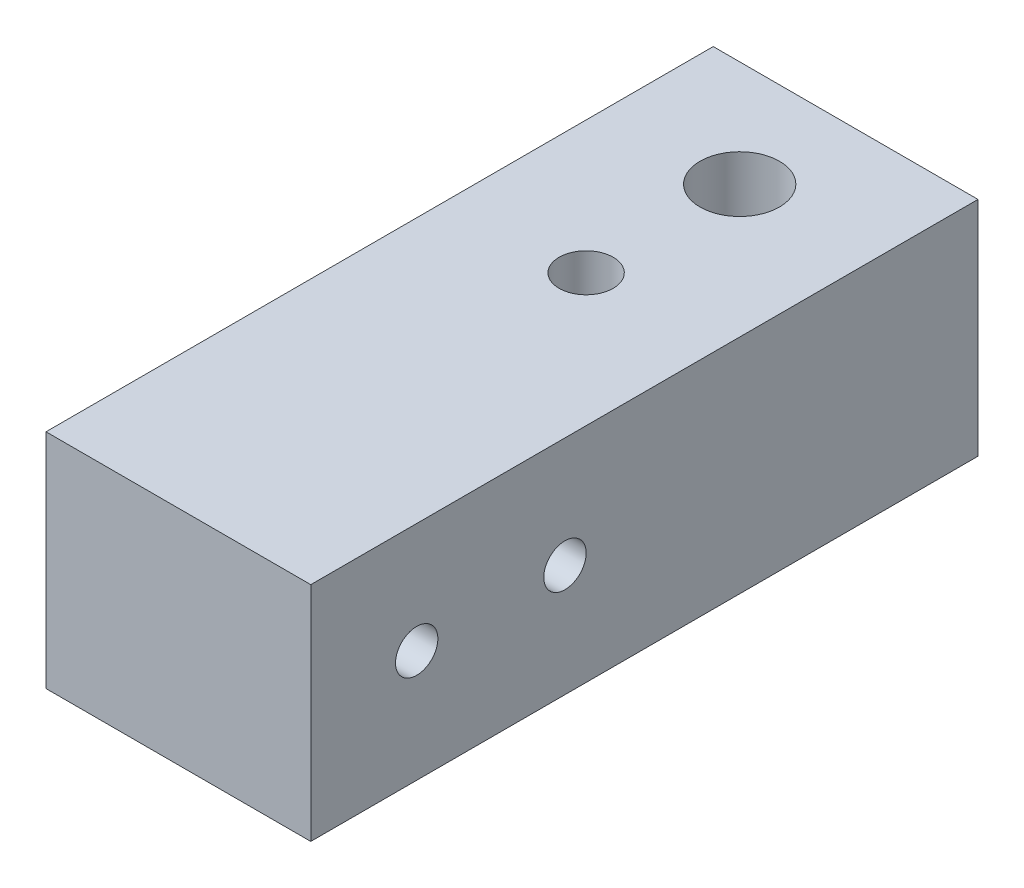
ISO-10303-21;
HEADER;
FILE_DESCRIPTION(('STEP AP214'),'2;1');
FILE_NAME('part.step','',(''),(''),'','','');
FILE_SCHEMA(('AUTOMOTIVE_DESIGN { 1 0 10303 214 1 1 1 1 }'));
ENDSEC;
DATA;
#1=APPLICATION_CONTEXT('core data for automotive mechanical design processes');
#2=APPLICATION_PROTOCOL_DEFINITION('international standard','automotive_design',2000,#1);
#3=PRODUCT_CONTEXT('',#1,'mechanical');
#4=PRODUCT('Part','Part','',(#3));
#5=PRODUCT_RELATED_PRODUCT_CATEGORY('part','',(#4));
#6=PRODUCT_DEFINITION_FORMATION('','',#4);
#7=PRODUCT_DEFINITION_CONTEXT('part definition',#1,'design');
#8=PRODUCT_DEFINITION('design','',#6,#7);
#9=PRODUCT_DEFINITION_SHAPE('','',#8);
#10=(LENGTH_UNIT() NAMED_UNIT(*) SI_UNIT(.MILLI.,.METRE.));
#11=(NAMED_UNIT(*) PLANE_ANGLE_UNIT() SI_UNIT($,.RADIAN.));
#12=(NAMED_UNIT(*) SI_UNIT($,.STERADIAN.) SOLID_ANGLE_UNIT());
#13=UNCERTAINTY_MEASURE_WITH_UNIT(LENGTH_MEASURE(1.E-05),#10,'distance_accuracy_value','');
#14=(GEOMETRIC_REPRESENTATION_CONTEXT(3) GLOBAL_UNCERTAINTY_ASSIGNED_CONTEXT((#13)) GLOBAL_UNIT_ASSIGNED_CONTEXT((#10,
#11,#12)) REPRESENTATION_CONTEXT('',''));
#15=CARTESIAN_POINT('',(0.,0.,0.));
#16=DIRECTION('',(0.,0.,1.));
#17=DIRECTION('',(1.,0.,0.));
#18=AXIS2_PLACEMENT_3D('',#15,#16,#17);
#19=CARTESIAN_POINT('',(552.991736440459,42.,-62.3836591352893));
#20=DIRECTION('',(0.,-1.,0.));
#21=DIRECTION('',(0.,0.,-1.));
#22=AXIS2_PLACEMENT_3D('',#19,#20,#21);
#23=CYLINDRICAL_SURFACE('',#22,3.99999999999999);
#24=CARTESIAN_POINT('',(552.991736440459,0.,-62.3836591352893));
#25=DIRECTION('',(0.,1.,0.));
#26=DIRECTION('',(0.,0.,1.));
#27=AXIS2_PLACEMENT_3D('',#24,#25,#26);
#28=CIRCLE('',#27,3.99999999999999);
#29=CARTESIAN_POINT('',(552.991736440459,0.,-66.3836591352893));
#30=VERTEX_POINT('',#29);
#31=EDGE_CURVE('E135',#30,#30,#28,.T.);
#32=CARTESIAN_POINT('',(552.991736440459,14.,-62.3836591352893));
#33=DIRECTION('',(0.,1.,0.));
#34=DIRECTION('',(0.,0.,1.));
#35=AXIS2_PLACEMENT_3D('',#32,#33,#34);
#36=CIRCLE('',#35,3.99999999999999);
#37=CARTESIAN_POINT('',(552.991736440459,14.,-66.3836591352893));
#38=VERTEX_POINT('',#37);
#39=EDGE_CURVE('E63',#38,#38,#36,.T.);
#40=CARTESIAN_POINT('',(552.991736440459,0.,-66.3836591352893));
#41=CARTESIAN_POINT('',(552.991736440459,0.145833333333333,-66.3836591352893));
#42=CARTESIAN_POINT('',(552.991736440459,0.291666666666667,-66.3836591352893));
#43=CARTESIAN_POINT('',(552.991736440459,0.583333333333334,-66.3836591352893));
#44=CARTESIAN_POINT('',(552.991736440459,0.729166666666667,-66.3836591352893));
#45=CARTESIAN_POINT('',(552.991736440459,1.02083333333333,-66.3836591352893));
#46=CARTESIAN_POINT('',(552.991736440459,1.16666666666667,-66.3836591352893));
#47=CARTESIAN_POINT('',(552.991736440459,1.45833333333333,-66.3836591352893));
#48=CARTESIAN_POINT('',(552.991736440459,1.60416666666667,-66.3836591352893));
#49=CARTESIAN_POINT('',(552.991736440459,1.89583333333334,-66.3836591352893));
#50=CARTESIAN_POINT('',(552.991736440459,2.04166666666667,-66.3836591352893));
#51=CARTESIAN_POINT('',(552.991736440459,2.33333333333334,-66.3836591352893));
#52=CARTESIAN_POINT('',(552.991736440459,2.47916666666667,-66.3836591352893));
#53=CARTESIAN_POINT('',(552.991736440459,2.77083333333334,-66.3836591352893));
#54=CARTESIAN_POINT('',(552.991736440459,2.91666666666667,-66.3836591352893));
#55=CARTESIAN_POINT('',(552.991736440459,3.20833333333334,-66.3836591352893));
#56=CARTESIAN_POINT('',(552.991736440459,3.35416666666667,-66.3836591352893));
#57=CARTESIAN_POINT('',(552.991736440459,3.64583333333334,-66.3836591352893));
#58=CARTESIAN_POINT('',(552.991736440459,3.79166666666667,-66.3836591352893));
#59=CARTESIAN_POINT('',(552.991736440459,4.08333333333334,-66.3836591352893));
#60=CARTESIAN_POINT('',(552.991736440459,4.22916666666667,-66.3836591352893));
#61=CARTESIAN_POINT('',(552.991736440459,4.52083333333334,-66.3836591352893));
#62=CARTESIAN_POINT('',(552.991736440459,4.66666666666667,-66.3836591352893));
#63=CARTESIAN_POINT('',(552.991736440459,4.95833333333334,-66.3836591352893));
#64=CARTESIAN_POINT('',(552.991736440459,5.10416666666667,-66.3836591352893));
#65=CARTESIAN_POINT('',(552.991736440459,5.39583333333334,-66.3836591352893));
#66=CARTESIAN_POINT('',(552.991736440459,5.54166666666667,-66.3836591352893));
#67=CARTESIAN_POINT('',(552.991736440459,5.83333333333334,-66.3836591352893));
#68=CARTESIAN_POINT('',(552.991736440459,5.97916666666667,-66.3836591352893));
#69=CARTESIAN_POINT('',(552.991736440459,6.27083333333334,-66.3836591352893));
#70=CARTESIAN_POINT('',(552.991736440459,6.41666666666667,-66.3836591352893));
#71=CARTESIAN_POINT('',(552.991736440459,6.70833333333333,-66.3836591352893));
#72=CARTESIAN_POINT('',(552.991736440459,6.85416666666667,-66.3836591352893));
#73=CARTESIAN_POINT('',(552.991736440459,7.14583333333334,-66.3836591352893));
#74=CARTESIAN_POINT('',(552.991736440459,7.29166666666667,-66.3836591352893));
#75=CARTESIAN_POINT('',(552.991736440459,7.58333333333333,-66.3836591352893));
#76=CARTESIAN_POINT('',(552.991736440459,7.72916666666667,-66.3836591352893));
#77=CARTESIAN_POINT('',(552.991736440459,8.02083333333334,-66.3836591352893));
#78=CARTESIAN_POINT('',(552.991736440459,8.16666666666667,-66.3836591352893));
#79=CARTESIAN_POINT('',(552.991736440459,8.45833333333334,-66.3836591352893));
#80=CARTESIAN_POINT('',(552.991736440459,8.60416666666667,-66.3836591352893));
#81=CARTESIAN_POINT('',(552.991736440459,8.89583333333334,-66.3836591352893));
#82=CARTESIAN_POINT('',(552.991736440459,9.04166666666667,-66.3836591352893));
#83=CARTESIAN_POINT('',(552.991736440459,9.33333333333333,-66.3836591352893));
#84=CARTESIAN_POINT('',(552.991736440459,9.47916666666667,-66.3836591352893));
#85=CARTESIAN_POINT('',(552.991736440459,9.77083333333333,-66.3836591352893));
#86=CARTESIAN_POINT('',(552.991736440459,9.91666666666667,-66.3836591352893));
#87=CARTESIAN_POINT('',(552.991736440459,10.2083333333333,-66.3836591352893));
#88=CARTESIAN_POINT('',(552.991736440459,10.3541666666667,-66.3836591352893));
#89=CARTESIAN_POINT('',(552.991736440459,10.6458333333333,-66.3836591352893));
#90=CARTESIAN_POINT('',(552.991736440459,10.7916666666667,-66.3836591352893));
#91=CARTESIAN_POINT('',(552.991736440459,11.0833333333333,-66.3836591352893));
#92=CARTESIAN_POINT('',(552.991736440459,11.2291666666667,-66.3836591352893));
#93=CARTESIAN_POINT('',(552.991736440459,11.5208333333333,-66.3836591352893));
#94=CARTESIAN_POINT('',(552.991736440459,11.6666666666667,-66.3836591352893));
#95=CARTESIAN_POINT('',(552.991736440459,11.9583333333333,-66.3836591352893));
#96=CARTESIAN_POINT('',(552.991736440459,12.1041666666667,-66.3836591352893));
#97=CARTESIAN_POINT('',(552.991736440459,12.3958333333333,-66.3836591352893));
#98=CARTESIAN_POINT('',(552.991736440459,12.5416666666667,-66.3836591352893));
#99=CARTESIAN_POINT('',(552.991736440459,12.8333333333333,-66.3836591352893));
#100=CARTESIAN_POINT('',(552.991736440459,12.9791666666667,-66.3836591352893));
#101=CARTESIAN_POINT('',(552.991736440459,13.2708333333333,-66.3836591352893));
#102=CARTESIAN_POINT('',(552.991736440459,13.4166666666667,-66.3836591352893));
#103=CARTESIAN_POINT('',(552.991736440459,13.7083333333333,-66.3836591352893));
#104=CARTESIAN_POINT('',(552.991736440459,13.8541666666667,-66.3836591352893));
#105=CARTESIAN_POINT('',(552.991736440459,14.,-66.3836591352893));
#106=B_SPLINE_CURVE_WITH_KNOTS('',3,(#40,#41,#42,#43,#44,#45,#46,#47,#48,#49,#50,#51,#52,#53,
#54,#55,#56,#57,#58,#59,#60,#61,#62,#63,#64,#65,#66,#67,#68,#69,#70,#71,#72,#73,#74,#75,#76,#77,
#78,#79,#80,#81,#82,#83,#84,#85,#86,#87,#88,#89,#90,#91,#92,#93,#94,#95,#96,#97,#98,#99,#100,
#101,#102,#103,#104,#105),.UNSPECIFIED.,.F.,.F.,(4,2,2,2,2,2,2,2,2,2,2,2,2,2,2,2,2,2,2,2,2,2,2,
2,2,2,2,2,2,2,2,2,4),(0.,0.4375,0.875000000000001,1.3125,1.75,2.1875,2.625,3.0625,3.5,3.9375,
4.375,4.8125,5.25,5.68750000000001,6.12500000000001,6.5625,7.00000000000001,7.4375,
7.87500000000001,8.3125,8.75000000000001,9.1875,9.625,10.0625,10.5,10.9375,11.375,11.8125,12.25,
12.6875,13.125,13.5625,14.),.UNSPECIFIED.);
#107=EDGE_CURVE('BSEAM60',#30,#38,#106,.T.);
#108=ORIENTED_EDGE('',*,*,#31,.F.);
#109=ORIENTED_EDGE('',*,*,#39,.T.);
#110=ORIENTED_EDGE('',*,*,#107,.T.);
#111=ORIENTED_EDGE('',*,*,#107,.F.);
#112=EDGE_LOOP('',(#108,#110,#109,#111));
#113=FACE_BOUND('',#112,.T.);
#114=ADVANCED_FACE('F60',(#113),#23,.F.);
#115=CARTESIAN_POINT('',(527.991736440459,42.,0.));
#116=DIRECTION('',(-1.,0.,0.));
#117=DIRECTION('',(0.,0.,1.));
#118=AXIS2_PLACEMENT_3D('',#115,#116,#117);
#119=PLANE('',#118);
#120=DIRECTION('',(0.,0.,-1.));
#121=VECTOR('',#120,1.);
#122=CARTESIAN_POINT('',(527.991736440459,0.,0.));
#123=LINE('',#122,#121);
#124=CARTESIAN_POINT('',(527.991736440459,0.,43.6163408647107));
#125=VERTEX_POINT('',#124);
#126=CARTESIAN_POINT('',(527.991736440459,0.,-82.3836591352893));
#127=VERTEX_POINT('',#126);
#128=EDGE_CURVE('E139',#125,#127,#123,.T.);
#129=ORIENTED_EDGE('',*,*,#128,.F.);
#130=DIRECTION('',(0.,-1.,0.));
#131=VECTOR('',#130,1.);
#132=CARTESIAN_POINT('',(527.991736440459,42.,43.6163408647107));
#133=LINE('',#132,#131);
#134=CARTESIAN_POINT('',(527.991736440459,42.,43.6163408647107));
#135=VERTEX_POINT('',#134);
#136=EDGE_CURVE('E12',#135,#125,#133,.T.);
#137=ORIENTED_EDGE('',*,*,#136,.F.);
#138=DIRECTION('',(0.,0.,-1.));
#139=VECTOR('',#138,1.);
#140=CARTESIAN_POINT('',(527.991736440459,42.,0.));
#141=LINE('',#140,#139);
#142=CARTESIAN_POINT('',(527.991736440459,42.,-82.3836591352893));
#143=VERTEX_POINT('',#142);
#144=EDGE_CURVE('E126',#135,#143,#141,.T.);
#145=ORIENTED_EDGE('',*,*,#144,.T.);
#146=DIRECTION('',(0.,-1.,0.));
#147=VECTOR('',#146,1.);
#148=CARTESIAN_POINT('',(527.991736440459,42.,-82.3836591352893));
#149=LINE('',#148,#147);
#150=EDGE_CURVE('E102',#143,#127,#149,.T.);
#151=ORIENTED_EDGE('',*,*,#150,.T.);
#152=EDGE_LOOP('',(#129,#137,#145,#151));
#153=FACE_BOUND('',#152,.T.);
#154=ADVANCED_FACE('F216',(#153),#119,.T.);
#155=CARTESIAN_POINT('',(0.,42.,43.6163408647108));
#156=DIRECTION('',(0.,0.,1.));
#157=DIRECTION('',(1.,0.,0.));
#158=AXIS2_PLACEMENT_3D('',#155,#156,#157);
#159=PLANE('',#158);
#160=DIRECTION('',(-1.,0.,0.));
#161=VECTOR('',#160,1.);
#162=CARTESIAN_POINT('',(0.,0.,43.6163408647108));
#163=LINE('',#162,#161);
#164=CARTESIAN_POINT('',(577.991736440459,0.,43.6163408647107));
#165=VERTEX_POINT('',#164);
#166=EDGE_CURVE('E114',#165,#125,#163,.T.);
#167=ORIENTED_EDGE('',*,*,#166,.F.);
#168=DIRECTION('',(0.,-1.,0.));
#169=VECTOR('',#168,1.);
#170=CARTESIAN_POINT('',(577.991736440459,42.,43.6163408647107));
#171=LINE('',#170,#169);
#172=CARTESIAN_POINT('',(577.991736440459,42.,43.6163408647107));
#173=VERTEX_POINT('',#172);
#174=EDGE_CURVE('E70',#173,#165,#171,.T.);
#175=ORIENTED_EDGE('',*,*,#174,.F.);
#176=DIRECTION('',(-1.,0.,0.));
#177=VECTOR('',#176,1.);
#178=CARTESIAN_POINT('',(0.,42.,43.6163408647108));
#179=LINE('',#178,#177);
#180=EDGE_CURVE('E112',#173,#135,#179,.T.);
#181=ORIENTED_EDGE('',*,*,#180,.T.);
#182=ORIENTED_EDGE('',*,*,#136,.T.);
#183=EDGE_LOOP('',(#167,#175,#181,#182));
#184=FACE_BOUND('',#183,.T.);
#185=ADVANCED_FACE('F110',(#184),#159,.T.);
#186=CARTESIAN_POINT('',(577.991736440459,42.,0.));
#187=DIRECTION('',(-1.,0.,0.));
#188=DIRECTION('',(0.,0.,1.));
#189=AXIS2_PLACEMENT_3D('',#186,#187,#188);
#190=PLANE('',#189);
#191=CARTESIAN_POINT('',(577.991736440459,21.172874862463,23.6163408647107));
#192=DIRECTION('',(-1.,0.,0.));
#193=DIRECTION('',(0.,0.,1.));
#194=AXIS2_PLACEMENT_3D('',#191,#192,#193);
#195=CIRCLE('',#194,4.);
#196=CARTESIAN_POINT('',(577.991736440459,21.172874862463,27.6163408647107));
#197=VERTEX_POINT('',#196);
#198=EDGE_CURVE('E140',#197,#197,#195,.T.);
#199=ORIENTED_EDGE('',*,*,#198,.T.);
#200=EDGE_LOOP('',(#199));
#201=FACE_BOUND('',#200,.T.);
#202=CARTESIAN_POINT('',(577.991736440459,21.172874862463,-4.3836591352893));
#203=DIRECTION('',(-1.,0.,0.));
#204=DIRECTION('',(0.,0.,1.));
#205=AXIS2_PLACEMENT_3D('',#202,#203,#204);
#206=CIRCLE('',#205,4.);
#207=CARTESIAN_POINT('',(577.991736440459,21.172874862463,-0.383659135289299));
#208=VERTEX_POINT('',#207);
#209=EDGE_CURVE('E180',#208,#208,#206,.T.);
#210=ORIENTED_EDGE('',*,*,#209,.T.);
#211=EDGE_LOOP('',(#210));
#212=FACE_BOUND('',#211,.T.);
#213=DIRECTION('',(0.,0.,-1.));
#214=VECTOR('',#213,1.);
#215=CARTESIAN_POINT('',(577.991736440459,0.,0.));
#216=LINE('',#215,#214);
#217=CARTESIAN_POINT('',(577.991736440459,0.,-82.3836591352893));
#218=VERTEX_POINT('',#217);
#219=EDGE_CURVE('E145',#165,#218,#216,.T.);
#220=ORIENTED_EDGE('',*,*,#219,.T.);
#221=DIRECTION('',(0.,-1.,0.));
#222=VECTOR('',#221,1.);
#223=CARTESIAN_POINT('',(577.991736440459,42.,-82.3836591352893));
#224=LINE('',#223,#222);
#225=CARTESIAN_POINT('',(577.991736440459,42.,-82.3836591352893));
#226=VERTEX_POINT('',#225);
#227=EDGE_CURVE('E118',#226,#218,#224,.T.);
#228=ORIENTED_EDGE('',*,*,#227,.F.);
#229=DIRECTION('',(0.,0.,-1.));
#230=VECTOR('',#229,1.);
#231=CARTESIAN_POINT('',(577.991736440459,42.,0.));
#232=LINE('',#231,#230);
#233=EDGE_CURVE('E121',#173,#226,#232,.T.);
#234=ORIENTED_EDGE('',*,*,#233,.F.);
#235=ORIENTED_EDGE('',*,*,#174,.T.);
#236=EDGE_LOOP('',(#220,#228,#234,#235));
#237=FACE_BOUND('',#236,.T.);
#238=ADVANCED_FACE('F122',(#201,#212,#237),#190,.F.);
#239=CARTESIAN_POINT('',(0.,42.,-82.3836591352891));
#240=DIRECTION('',(0.,0.,1.));
#241=DIRECTION('',(1.,0.,0.));
#242=AXIS2_PLACEMENT_3D('',#239,#240,#241);
#243=PLANE('',#242);
#244=DIRECTION('',(-1.,0.,0.));
#245=VECTOR('',#244,1.);
#246=CARTESIAN_POINT('',(0.,0.,-82.3836591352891));
#247=LINE('',#246,#245);
#248=EDGE_CURVE('E95',#218,#127,#247,.T.);
#249=ORIENTED_EDGE('',*,*,#248,.T.);
#250=ORIENTED_EDGE('',*,*,#150,.F.);
#251=DIRECTION('',(-1.,0.,0.));
#252=VECTOR('',#251,1.);
#253=CARTESIAN_POINT('',(0.,42.,-82.3836591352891));
#254=LINE('',#253,#252);
#255=EDGE_CURVE('E79',#226,#143,#254,.T.);
#256=ORIENTED_EDGE('',*,*,#255,.F.);
#257=ORIENTED_EDGE('',*,*,#227,.T.);
#258=EDGE_LOOP('',(#249,#250,#256,#257));
#259=FACE_BOUND('',#258,.T.);
#260=ADVANCED_FACE('F285',(#259),#243,.F.);
#261=CARTESIAN_POINT('',(0.,42.,0.));
#262=DIRECTION('',(0.,1.,0.));
#263=DIRECTION('',(0.,0.,1.));
#264=AXIS2_PLACEMENT_3D('',#261,#262,#263);
#265=PLANE('',#264);
#266=CARTESIAN_POINT('',(552.991736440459,42.,-62.3836591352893));
#267=DIRECTION('',(0.,1.,0.));
#268=DIRECTION('',(0.,0.,1.));
#269=AXIS2_PLACEMENT_3D('',#266,#267,#268);
#270=CIRCLE('',#269,7.49999999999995);
#271=CARTESIAN_POINT('',(552.991736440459,42.,-54.8836591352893));
#272=VERTEX_POINT('',#271);
#273=EDGE_CURVE('E233',#272,#272,#270,.T.);
#274=ORIENTED_EDGE('',*,*,#273,.F.);
#275=EDGE_LOOP('',(#274));
#276=FACE_BOUND('',#275,.T.);
#277=CARTESIAN_POINT('',(552.991736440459,42.,-33.3836591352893));
#278=DIRECTION('',(0.,1.,0.));
#279=DIRECTION('',(0.,0.,1.));
#280=AXIS2_PLACEMENT_3D('',#277,#278,#279);
#281=CIRCLE('',#280,5.09999999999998);
#282=CARTESIAN_POINT('',(552.991736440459,42.,-38.4836591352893));
#283=VERTEX_POINT('',#282);
#284=EDGE_CURVE('E157',#283,#283,#281,.T.);
#285=ORIENTED_EDGE('',*,*,#284,.F.);
#286=EDGE_LOOP('',(#285));
#287=FACE_BOUND('',#286,.T.);
#288=ORIENTED_EDGE('',*,*,#144,.F.);
#289=ORIENTED_EDGE('',*,*,#180,.F.);
#290=ORIENTED_EDGE('',*,*,#233,.T.);
#291=ORIENTED_EDGE('',*,*,#255,.T.);
#292=EDGE_LOOP('',(#288,#289,#290,#291));
#293=FACE_BOUND('',#292,.T.);
#294=ADVANCED_FACE('F125',(#276,#287,#293),#265,.T.);
#295=CARTESIAN_POINT('',(0.,0.,0.));
#296=DIRECTION('',(0.,1.,0.));
#297=DIRECTION('',(0.,0.,1.));
#298=AXIS2_PLACEMENT_3D('',#295,#296,#297);
#299=PLANE('',#298);
#300=CARTESIAN_POINT('',(552.991736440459,0.,-33.3836591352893));
#301=DIRECTION('',(0.,-1.,0.));
#302=DIRECTION('',(0.,0.,-1.));
#303=AXIS2_PLACEMENT_3D('',#300,#301,#302);
#304=CIRCLE('',#303,11.);
#305=CARTESIAN_POINT('',(552.991736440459,0.,-44.3836591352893));
#306=VERTEX_POINT('',#305);
#307=EDGE_CURVE('E156',#306,#306,#304,.T.);
#308=ORIENTED_EDGE('',*,*,#307,.F.);
#309=EDGE_LOOP('',(#308));
#310=FACE_BOUND('',#309,.T.);
#311=ORIENTED_EDGE('',*,*,#31,.T.);
#312=EDGE_LOOP('',(#311));
#313=FACE_BOUND('',#312,.T.);
#314=ORIENTED_EDGE('',*,*,#128,.T.);
#315=ORIENTED_EDGE('',*,*,#248,.F.);
#316=ORIENTED_EDGE('',*,*,#219,.F.);
#317=ORIENTED_EDGE('',*,*,#166,.T.);
#318=EDGE_LOOP('',(#314,#315,#316,#317));
#319=FACE_BOUND('',#318,.T.);
#320=ADVANCED_FACE('F201',(#310,#313,#319),#299,.F.);
#321=CARTESIAN_POINT('',(577.991736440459,21.172874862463,-4.3836591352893));
#322=DIRECTION('',(-1.,0.,0.));
#323=DIRECTION('',(0.,0.,1.));
#324=AXIS2_PLACEMENT_3D('',#321,#322,#323);
#325=CYLINDRICAL_SURFACE('',#324,4.);
#326=ORIENTED_EDGE('',*,*,#209,.F.);
#327=EDGE_LOOP('',(#326));
#328=FACE_BOUND('',#327,.T.);
#329=CARTESIAN_POINT('',(537.991736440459,21.172874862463,-4.3836591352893));
#330=DIRECTION('',(-1.,0.,0.));
#331=DIRECTION('',(0.,0.,1.));
#332=AXIS2_PLACEMENT_3D('',#329,#330,#331);
#333=CIRCLE('',#332,4.);
#334=CARTESIAN_POINT('',(537.991736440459,21.172874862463,-0.383659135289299));
#335=VERTEX_POINT('',#334);
#336=EDGE_CURVE('E189',#335,#335,#333,.T.);
#337=ORIENTED_EDGE('',*,*,#336,.T.);
#338=EDGE_LOOP('',(#337));
#339=FACE_BOUND('',#338,.T.);
#340=ADVANCED_FACE('F197',(#328,#339),#325,.F.);
#341=CARTESIAN_POINT('',(537.991736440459,21.172874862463,-4.3836591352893));
#342=DIRECTION('',(-1.,0.,0.));
#343=DIRECTION('',(0.,0.,1.));
#344=AXIS2_PLACEMENT_3D('',#341,#342,#343);
#345=PLANE('',#344);
#346=ORIENTED_EDGE('',*,*,#336,.F.);
#347=EDGE_LOOP('',(#346));
#348=FACE_BOUND('',#347,.T.);
#349=ADVANCED_FACE('F200',(#348),#345,.F.);
#350=CARTESIAN_POINT('',(577.991736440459,21.172874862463,23.6163408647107));
#351=DIRECTION('',(-1.,0.,0.));
#352=DIRECTION('',(0.,0.,1.));
#353=AXIS2_PLACEMENT_3D('',#350,#351,#352);
#354=CYLINDRICAL_SURFACE('',#353,4.);
#355=ORIENTED_EDGE('',*,*,#198,.F.);
#356=EDGE_LOOP('',(#355));
#357=FACE_BOUND('',#356,.T.);
#358=CARTESIAN_POINT('',(537.991736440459,21.172874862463,23.6163408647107));
#359=DIRECTION('',(-1.,0.,0.));
#360=DIRECTION('',(0.,0.,1.));
#361=AXIS2_PLACEMENT_3D('',#358,#359,#360);
#362=CIRCLE('',#361,4.);
#363=CARTESIAN_POINT('',(537.991736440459,21.172874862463,27.6163408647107));
#364=VERTEX_POINT('',#363);
#365=EDGE_CURVE('E185',#364,#364,#362,.T.);
#366=ORIENTED_EDGE('',*,*,#365,.T.);
#367=EDGE_LOOP('',(#366));
#368=FACE_BOUND('',#367,.T.);
#369=ADVANCED_FACE('F206',(#357,#368),#354,.F.);
#370=CARTESIAN_POINT('',(537.991736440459,21.172874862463,23.6163408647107));
#371=DIRECTION('',(-1.,0.,0.));
#372=DIRECTION('',(0.,0.,1.));
#373=AXIS2_PLACEMENT_3D('',#370,#371,#372);
#374=PLANE('',#373);
#375=ORIENTED_EDGE('',*,*,#365,.F.);
#376=EDGE_LOOP('',(#375));
#377=FACE_BOUND('',#376,.T.);
#378=ADVANCED_FACE('F211',(#377),#374,.F.);
#379=CARTESIAN_POINT('',(552.991736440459,10.,-33.3836591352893));
#380=DIRECTION('',(0.,-1.,0.));
#381=DIRECTION('',(0.,0.,-1.));
#382=AXIS2_PLACEMENT_3D('',#379,#380,#381);
#383=CYLINDRICAL_SURFACE('',#382,11.);
#384=CARTESIAN_POINT('',(552.991736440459,10.,-33.3836591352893));
#385=DIRECTION('',(0.,-1.,0.));
#386=DIRECTION('',(0.,0.,-1.));
#387=AXIS2_PLACEMENT_3D('',#384,#385,#386);
#388=CIRCLE('',#387,11.);
#389=CARTESIAN_POINT('',(552.991736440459,10.,-44.3836591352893));
#390=VERTEX_POINT('',#389);
#391=EDGE_CURVE('E163',#390,#390,#388,.T.);
#392=ORIENTED_EDGE('',*,*,#391,.F.);
#393=EDGE_LOOP('',(#392));
#394=FACE_BOUND('',#393,.T.);
#395=ORIENTED_EDGE('',*,*,#307,.T.);
#396=EDGE_LOOP('',(#395));
#397=FACE_BOUND('',#396,.T.);
#398=ADVANCED_FACE('F268',(#394,#397),#383,.F.);
#399=CARTESIAN_POINT('',(552.991736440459,10.,-33.3836591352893));
#400=DIRECTION('',(0.,-1.,0.));
#401=DIRECTION('',(0.,0.,-1.));
#402=AXIS2_PLACEMENT_3D('',#399,#400,#401);
#403=PLANE('',#402);
#404=CARTESIAN_POINT('',(552.991736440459,10.,-25.3836591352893));
#405=DIRECTION('',(0.,-1.,0.));
#406=DIRECTION('',(0.,0.,-1.));
#407=AXIS2_PLACEMENT_3D('',#404,#405,#406);
#408=CIRCLE('',#407,1.74999999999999);
#409=CARTESIAN_POINT('',(552.991736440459,10.,-27.1336591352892));
#410=VERTEX_POINT('',#409);
#411=EDGE_CURVE('E172',#410,#410,#408,.T.);
#412=ORIENTED_EDGE('',*,*,#411,.F.);
#413=EDGE_LOOP('',(#412));
#414=FACE_BOUND('',#413,.T.);
#415=CARTESIAN_POINT('',(560.991736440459,10.,-33.3836591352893));
#416=DIRECTION('',(0.,-1.,0.));
#417=DIRECTION('',(0.,0.,-1.));
#418=AXIS2_PLACEMENT_3D('',#415,#416,#417);
#419=CIRCLE('',#418,1.74999999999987);
#420=CARTESIAN_POINT('',(560.991736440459,10.,-35.1336591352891));
#421=VERTEX_POINT('',#420);
#422=EDGE_CURVE('E244',#421,#421,#419,.T.);
#423=ORIENTED_EDGE('',*,*,#422,.F.);
#424=EDGE_LOOP('',(#423));
#425=FACE_BOUND('',#424,.T.);
#426=CARTESIAN_POINT('',(552.991736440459,10.,-41.3836591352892));
#427=DIRECTION('',(0.,-1.,0.));
#428=DIRECTION('',(0.,0.,-1.));
#429=AXIS2_PLACEMENT_3D('',#426,#427,#428);
#430=CIRCLE('',#429,1.74999999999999);
#431=CARTESIAN_POINT('',(552.991736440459,10.,-43.1336591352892));
#432=VERTEX_POINT('',#431);
#433=EDGE_CURVE('E252',#432,#432,#430,.T.);
#434=ORIENTED_EDGE('',*,*,#433,.F.);
#435=EDGE_LOOP('',(#434));
#436=FACE_BOUND('',#435,.T.);
#437=CARTESIAN_POINT('',(544.991736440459,10.,-33.3836591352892));
#438=DIRECTION('',(0.,-1.,0.));
#439=DIRECTION('',(0.,0.,-1.));
#440=AXIS2_PLACEMENT_3D('',#437,#438,#439);
#441=CIRCLE('',#440,1.74999999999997);
#442=CARTESIAN_POINT('',(544.991736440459,10.,-35.1336591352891));
#443=VERTEX_POINT('',#442);
#444=EDGE_CURVE('E231',#443,#443,#441,.T.);
#445=ORIENTED_EDGE('',*,*,#444,.F.);
#446=EDGE_LOOP('',(#445));
#447=FACE_BOUND('',#446,.T.);
#448=CARTESIAN_POINT('',(552.991736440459,10.,-33.3836591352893));
#449=DIRECTION('',(0.,-1.,0.));
#450=DIRECTION('',(0.,0.,-1.));
#451=AXIS2_PLACEMENT_3D('',#448,#449,#450);
#452=CIRCLE('',#451,5.09999999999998);
#453=CARTESIAN_POINT('',(552.991736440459,10.,-38.4836591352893));
#454=VERTEX_POINT('',#453);
#455=EDGE_CURVE('E153',#454,#454,#452,.F.);
#456=ORIENTED_EDGE('',*,*,#455,.T.);
#457=EDGE_LOOP('',(#456));
#458=FACE_BOUND('',#457,.T.);
#459=ORIENTED_EDGE('',*,*,#391,.T.);
#460=EDGE_LOOP('',(#459));
#461=FACE_BOUND('',#460,.T.);
#462=ADVANCED_FACE('F265',(#414,#425,#436,#447,#458,#461),#403,.T.);
#463=CARTESIAN_POINT('',(552.991736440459,42.,-33.3836591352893));
#464=DIRECTION('',(0.,-1.,0.));
#465=DIRECTION('',(0.,0.,-1.));
#466=AXIS2_PLACEMENT_3D('',#463,#464,#465);
#467=CYLINDRICAL_SURFACE('',#466,5.09999999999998);
#468=CARTESIAN_POINT('',(552.991736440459,10.,-38.4836591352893));
#469=CARTESIAN_POINT('',(552.991736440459,10.3333333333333,-38.4836591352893));
#470=CARTESIAN_POINT('',(552.991736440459,10.6666666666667,-38.4836591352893));
#471=CARTESIAN_POINT('',(552.991736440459,11.3333333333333,-38.4836591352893));
#472=CARTESIAN_POINT('',(552.991736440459,11.6666666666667,-38.4836591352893));
#473=CARTESIAN_POINT('',(552.991736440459,12.3333333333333,-38.4836591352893));
#474=CARTESIAN_POINT('',(552.991736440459,12.6666666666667,-38.4836591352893));
#475=CARTESIAN_POINT('',(552.991736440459,13.3333333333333,-38.4836591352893));
#476=CARTESIAN_POINT('',(552.991736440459,13.6666666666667,-38.4836591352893));
#477=CARTESIAN_POINT('',(552.991736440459,14.3333333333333,-38.4836591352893));
#478=CARTESIAN_POINT('',(552.991736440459,14.6666666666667,-38.4836591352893));
#479=CARTESIAN_POINT('',(552.991736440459,15.3333333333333,-38.4836591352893));
#480=CARTESIAN_POINT('',(552.991736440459,15.6666666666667,-38.4836591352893));
#481=CARTESIAN_POINT('',(552.991736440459,16.3333333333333,-38.4836591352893));
#482=CARTESIAN_POINT('',(552.991736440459,16.6666666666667,-38.4836591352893));
#483=CARTESIAN_POINT('',(552.991736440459,17.3333333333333,-38.4836591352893));
#484=CARTESIAN_POINT('',(552.991736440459,17.6666666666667,-38.4836591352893));
#485=CARTESIAN_POINT('',(552.991736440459,18.3333333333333,-38.4836591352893));
#486=CARTESIAN_POINT('',(552.991736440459,18.6666666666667,-38.4836591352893));
#487=CARTESIAN_POINT('',(552.991736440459,19.3333333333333,-38.4836591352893));
#488=CARTESIAN_POINT('',(552.991736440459,19.6666666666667,-38.4836591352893));
#489=CARTESIAN_POINT('',(552.991736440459,20.3333333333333,-38.4836591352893));
#490=CARTESIAN_POINT('',(552.991736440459,20.6666666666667,-38.4836591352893));
#491=CARTESIAN_POINT('',(552.991736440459,21.3333333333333,-38.4836591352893));
#492=CARTESIAN_POINT('',(552.991736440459,21.6666666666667,-38.4836591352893));
#493=CARTESIAN_POINT('',(552.991736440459,22.3333333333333,-38.4836591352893));
#494=CARTESIAN_POINT('',(552.991736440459,22.6666666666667,-38.4836591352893));
#495=CARTESIAN_POINT('',(552.991736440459,23.3333333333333,-38.4836591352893));
#496=CARTESIAN_POINT('',(552.991736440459,23.6666666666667,-38.4836591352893));
#497=CARTESIAN_POINT('',(552.991736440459,24.3333333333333,-38.4836591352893));
#498=CARTESIAN_POINT('',(552.991736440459,24.6666666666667,-38.4836591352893));
#499=CARTESIAN_POINT('',(552.991736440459,25.3333333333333,-38.4836591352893));
#500=CARTESIAN_POINT('',(552.991736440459,25.6666666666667,-38.4836591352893));
#501=CARTESIAN_POINT('',(552.991736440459,26.3333333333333,-38.4836591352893));
#502=CARTESIAN_POINT('',(552.991736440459,26.6666666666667,-38.4836591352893));
#503=CARTESIAN_POINT('',(552.991736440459,27.3333333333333,-38.4836591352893));
#504=CARTESIAN_POINT('',(552.991736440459,27.6666666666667,-38.4836591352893));
#505=CARTESIAN_POINT('',(552.991736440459,28.3333333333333,-38.4836591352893));
#506=CARTESIAN_POINT('',(552.991736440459,28.6666666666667,-38.4836591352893));
#507=CARTESIAN_POINT('',(552.991736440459,29.3333333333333,-38.4836591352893));
#508=CARTESIAN_POINT('',(552.991736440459,29.6666666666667,-38.4836591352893));
#509=CARTESIAN_POINT('',(552.991736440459,30.3333333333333,-38.4836591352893));
#510=CARTESIAN_POINT('',(552.991736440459,30.6666666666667,-38.4836591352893));
#511=CARTESIAN_POINT('',(552.991736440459,31.3333333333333,-38.4836591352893));
#512=CARTESIAN_POINT('',(552.991736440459,31.6666666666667,-38.4836591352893));
#513=CARTESIAN_POINT('',(552.991736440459,32.3333333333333,-38.4836591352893));
#514=CARTESIAN_POINT('',(552.991736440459,32.6666666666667,-38.4836591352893));
#515=CARTESIAN_POINT('',(552.991736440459,33.3333333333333,-38.4836591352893));
#516=CARTESIAN_POINT('',(552.991736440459,33.6666666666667,-38.4836591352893));
#517=CARTESIAN_POINT('',(552.991736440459,34.3333333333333,-38.4836591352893));
#518=CARTESIAN_POINT('',(552.991736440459,34.6666666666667,-38.4836591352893));
#519=CARTESIAN_POINT('',(552.991736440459,35.3333333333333,-38.4836591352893));
#520=CARTESIAN_POINT('',(552.991736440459,35.6666666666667,-38.4836591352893));
#521=CARTESIAN_POINT('',(552.991736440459,36.3333333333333,-38.4836591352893));
#522=CARTESIAN_POINT('',(552.991736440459,36.6666666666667,-38.4836591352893));
#523=CARTESIAN_POINT('',(552.991736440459,37.3333333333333,-38.4836591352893));
#524=CARTESIAN_POINT('',(552.991736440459,37.6666666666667,-38.4836591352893));
#525=CARTESIAN_POINT('',(552.991736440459,38.3333333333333,-38.4836591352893));
#526=CARTESIAN_POINT('',(552.991736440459,38.6666666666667,-38.4836591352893));
#527=CARTESIAN_POINT('',(552.991736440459,39.3333333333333,-38.4836591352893));
#528=CARTESIAN_POINT('',(552.991736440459,39.6666666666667,-38.4836591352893));
#529=CARTESIAN_POINT('',(552.991736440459,40.3333333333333,-38.4836591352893));
#530=CARTESIAN_POINT('',(552.991736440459,40.6666666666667,-38.4836591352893));
#531=CARTESIAN_POINT('',(552.991736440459,41.3333333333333,-38.4836591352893));
#532=CARTESIAN_POINT('',(552.991736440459,41.6666666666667,-38.4836591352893));
#533=CARTESIAN_POINT('',(552.991736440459,42.,-38.4836591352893));
#534=B_SPLINE_CURVE_WITH_KNOTS('',3,(#468,#469,#470,#471,#472,#473,#474,#475,#476,#477,#478,
#479,#480,#481,#482,#483,#484,#485,#486,#487,#488,#489,#490,#491,#492,#493,#494,#495,#496,#497,
#498,#499,#500,#501,#502,#503,#504,#505,#506,#507,#508,#509,#510,#511,#512,#513,#514,#515,#516,
#517,#518,#519,#520,#521,#522,#523,#524,#525,#526,#527,#528,#529,#530,#531,#532,#533),
.UNSPECIFIED.,.F.,.F.,(4,2,2,2,2,2,2,2,2,2,2,2,2,2,2,2,2,2,2,2,2,2,2,2,2,2,2,2,2,2,2,2,4),(0.,
0.999999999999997,1.99999999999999,3.,4.,4.99999999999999,5.99999999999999,7.,8.,
8.99999999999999,9.99999999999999,11.,12.,13.,14.,15.,16.,17.,18.,19.,20.,21.,22.,23.,24.,25.,
26.,27.,28.,29.,30.,31.,32.),.UNSPECIFIED.);
#535=EDGE_CURVE('BSEAM267',#454,#283,#534,.T.);
#536=ORIENTED_EDGE('',*,*,#455,.F.);
#537=ORIENTED_EDGE('',*,*,#284,.T.);
#538=ORIENTED_EDGE('',*,*,#535,.T.);
#539=ORIENTED_EDGE('',*,*,#535,.F.);
#540=EDGE_LOOP('',(#536,#538,#537,#539));
#541=FACE_BOUND('',#540,.T.);
#542=ADVANCED_FACE('F267',(#541),#467,.F.);
#543=CARTESIAN_POINT('',(544.991736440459,15.,-33.3836591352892));
#544=DIRECTION('',(0.,-1.,0.));
#545=DIRECTION('',(0.,0.,-1.));
#546=AXIS2_PLACEMENT_3D('',#543,#544,#545);
#547=CYLINDRICAL_SURFACE('',#546,1.74999999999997);
#548=CARTESIAN_POINT('',(544.991736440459,15.,-33.3836591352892));
#549=DIRECTION('',(0.,-1.,0.));
#550=DIRECTION('',(0.,0.,-1.));
#551=AXIS2_PLACEMENT_3D('',#548,#549,#550);
#552=CIRCLE('',#551,1.74999999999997);
#553=CARTESIAN_POINT('',(544.991736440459,15.,-35.1336591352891));
#554=VERTEX_POINT('',#553);
#555=EDGE_CURVE('E176',#554,#554,#552,.T.);
#556=ORIENTED_EDGE('',*,*,#555,.F.);
#557=EDGE_LOOP('',(#556));
#558=FACE_BOUND('',#557,.T.);
#559=ORIENTED_EDGE('',*,*,#444,.T.);
#560=EDGE_LOOP('',(#559));
#561=FACE_BOUND('',#560,.T.);
#562=ADVANCED_FACE('F263',(#558,#561),#547,.F.);
#563=CARTESIAN_POINT('',(544.991736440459,15.,-33.3836591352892));
#564=DIRECTION('',(0.,-1.,0.));
#565=DIRECTION('',(0.,0.,-1.));
#566=AXIS2_PLACEMENT_3D('',#563,#564,#565);
#567=PLANE('',#566);
#568=ORIENTED_EDGE('',*,*,#555,.T.);
#569=EDGE_LOOP('',(#568));
#570=FACE_BOUND('',#569,.T.);
#571=ADVANCED_FACE('F404',(#570),#567,.T.);
#572=CARTESIAN_POINT('',(552.991736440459,15.,-41.3836591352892));
#573=DIRECTION('',(0.,-1.,0.));
#574=DIRECTION('',(0.,0.,-1.));
#575=AXIS2_PLACEMENT_3D('',#572,#573,#574);
#576=CYLINDRICAL_SURFACE('',#575,1.74999999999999);
#577=CARTESIAN_POINT('',(552.991736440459,15.,-41.3836591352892));
#578=DIRECTION('',(0.,-1.,0.));
#579=DIRECTION('',(0.,0.,-1.));
#580=AXIS2_PLACEMENT_3D('',#577,#578,#579);
#581=CIRCLE('',#580,1.74999999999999);
#582=CARTESIAN_POINT('',(552.991736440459,15.,-43.1336591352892));
#583=VERTEX_POINT('',#582);
#584=EDGE_CURVE('E256',#583,#583,#581,.T.);
#585=ORIENTED_EDGE('',*,*,#584,.F.);
#586=EDGE_LOOP('',(#585));
#587=FACE_BOUND('',#586,.T.);
#588=ORIENTED_EDGE('',*,*,#433,.T.);
#589=EDGE_LOOP('',(#588));
#590=FACE_BOUND('',#589,.T.);
#591=ADVANCED_FACE('F394',(#587,#590),#576,.F.);
#592=CARTESIAN_POINT('',(552.991736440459,15.,-41.3836591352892));
#593=DIRECTION('',(0.,-1.,0.));
#594=DIRECTION('',(0.,0.,-1.));
#595=AXIS2_PLACEMENT_3D('',#592,#593,#594);
#596=PLANE('',#595);
#597=ORIENTED_EDGE('',*,*,#584,.T.);
#598=EDGE_LOOP('',(#597));
#599=FACE_BOUND('',#598,.T.);
#600=ADVANCED_FACE('F384',(#599),#596,.T.);
#601=CARTESIAN_POINT('',(560.991736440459,15.,-33.3836591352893));
#602=DIRECTION('',(0.,-1.,0.));
#603=DIRECTION('',(0.,0.,-1.));
#604=AXIS2_PLACEMENT_3D('',#601,#602,#603);
#605=CYLINDRICAL_SURFACE('',#604,1.74999999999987);
#606=CARTESIAN_POINT('',(560.991736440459,15.,-33.3836591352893));
#607=DIRECTION('',(0.,-1.,0.));
#608=DIRECTION('',(0.,0.,-1.));
#609=AXIS2_PLACEMENT_3D('',#606,#607,#608);
#610=CIRCLE('',#609,1.74999999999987);
#611=CARTESIAN_POINT('',(560.991736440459,15.,-35.1336591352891));
#612=VERTEX_POINT('',#611);
#613=EDGE_CURVE('E248',#612,#612,#610,.T.);
#614=ORIENTED_EDGE('',*,*,#613,.F.);
#615=EDGE_LOOP('',(#614));
#616=FACE_BOUND('',#615,.T.);
#617=ORIENTED_EDGE('',*,*,#422,.T.);
#618=EDGE_LOOP('',(#617));
#619=FACE_BOUND('',#618,.T.);
#620=ADVANCED_FACE('F374',(#616,#619),#605,.F.);
#621=CARTESIAN_POINT('',(560.991736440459,15.,-33.3836591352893));
#622=DIRECTION('',(0.,-1.,0.));
#623=DIRECTION('',(0.,0.,-1.));
#624=AXIS2_PLACEMENT_3D('',#621,#622,#623);
#625=PLANE('',#624);
#626=ORIENTED_EDGE('',*,*,#613,.T.);
#627=EDGE_LOOP('',(#626));
#628=FACE_BOUND('',#627,.T.);
#629=ADVANCED_FACE('F364',(#628),#625,.T.);
#630=CARTESIAN_POINT('',(552.991736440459,15.,-25.3836591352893));
#631=DIRECTION('',(0.,-1.,0.));
#632=DIRECTION('',(0.,0.,-1.));
#633=AXIS2_PLACEMENT_3D('',#630,#631,#632);
#634=CYLINDRICAL_SURFACE('',#633,1.74999999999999);
#635=CARTESIAN_POINT('',(552.991736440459,15.,-25.3836591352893));
#636=DIRECTION('',(0.,-1.,0.));
#637=DIRECTION('',(0.,0.,-1.));
#638=AXIS2_PLACEMENT_3D('',#635,#636,#637);
#639=CIRCLE('',#638,1.74999999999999);
#640=CARTESIAN_POINT('',(552.991736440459,15.,-27.1336591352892));
#641=VERTEX_POINT('',#640);
#642=EDGE_CURVE('E166',#641,#641,#639,.T.);
#643=ORIENTED_EDGE('',*,*,#642,.F.);
#644=EDGE_LOOP('',(#643));
#645=FACE_BOUND('',#644,.T.);
#646=ORIENTED_EDGE('',*,*,#411,.T.);
#647=EDGE_LOOP('',(#646));
#648=FACE_BOUND('',#647,.T.);
#649=ADVANCED_FACE('F355',(#645,#648),#634,.F.);
#650=CARTESIAN_POINT('',(552.991736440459,15.,-25.3836591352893));
#651=DIRECTION('',(0.,-1.,0.));
#652=DIRECTION('',(0.,0.,-1.));
#653=AXIS2_PLACEMENT_3D('',#650,#651,#652);
#654=PLANE('',#653);
#655=ORIENTED_EDGE('',*,*,#642,.T.);
#656=EDGE_LOOP('',(#655));
#657=FACE_BOUND('',#656,.T.);
#658=ADVANCED_FACE('F329',(#657),#654,.T.);
#659=CARTESIAN_POINT('',(552.991736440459,14.,-62.3836591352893));
#660=DIRECTION('',(0.,1.,0.));
#661=DIRECTION('',(0.,0.,1.));
#662=AXIS2_PLACEMENT_3D('',#659,#660,#661);
#663=CYLINDRICAL_SURFACE('',#662,7.49999999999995);
#664=CARTESIAN_POINT('',(552.991736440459,14.,-62.3836591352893));
#665=DIRECTION('',(0.,1.,0.));
#666=DIRECTION('',(0.,0.,1.));
#667=AXIS2_PLACEMENT_3D('',#664,#665,#666);
#668=CIRCLE('',#667,7.49999999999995);
#669=CARTESIAN_POINT('',(552.991736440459,14.,-54.8836591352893));
#670=VERTEX_POINT('',#669);
#671=EDGE_CURVE('E227',#670,#670,#668,.T.);
#672=ORIENTED_EDGE('',*,*,#671,.F.);
#673=EDGE_LOOP('',(#672));
#674=FACE_BOUND('',#673,.T.);
#675=ORIENTED_EDGE('',*,*,#273,.T.);
#676=EDGE_LOOP('',(#675));
#677=FACE_BOUND('',#676,.T.);
#678=ADVANCED_FACE('F323',(#674,#677),#663,.F.);
#679=CARTESIAN_POINT('',(552.991736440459,14.,-62.3836591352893));
#680=DIRECTION('',(0.,1.,0.));
#681=DIRECTION('',(0.,0.,1.));
#682=AXIS2_PLACEMENT_3D('',#679,#680,#681);
#683=PLANE('',#682);
#684=ORIENTED_EDGE('',*,*,#39,.F.);
#685=EDGE_LOOP('',(#684));
#686=FACE_BOUND('',#685,.T.);
#687=ORIENTED_EDGE('',*,*,#671,.T.);
#688=EDGE_LOOP('',(#687));
#689=FACE_BOUND('',#688,.T.);
#690=ADVANCED_FACE('F328',(#686,#689),#683,.T.);
#691=CLOSED_SHELL('',(#114,#154,#185,#238,#260,#294,#320,#340,#349,#369,#378,#398,#462,#542,
#562,#571,#591,#600,#620,#629,#649,#658,#678,#690));
#692=MANIFOLD_SOLID_BREP('B2',#691);
#693=ADVANCED_BREP_SHAPE_REPRESENTATION('',(#18,#692),#14);
#694=SHAPE_DEFINITION_REPRESENTATION(#9,#693);
ENDSEC;
END-ISO-10303-21;
